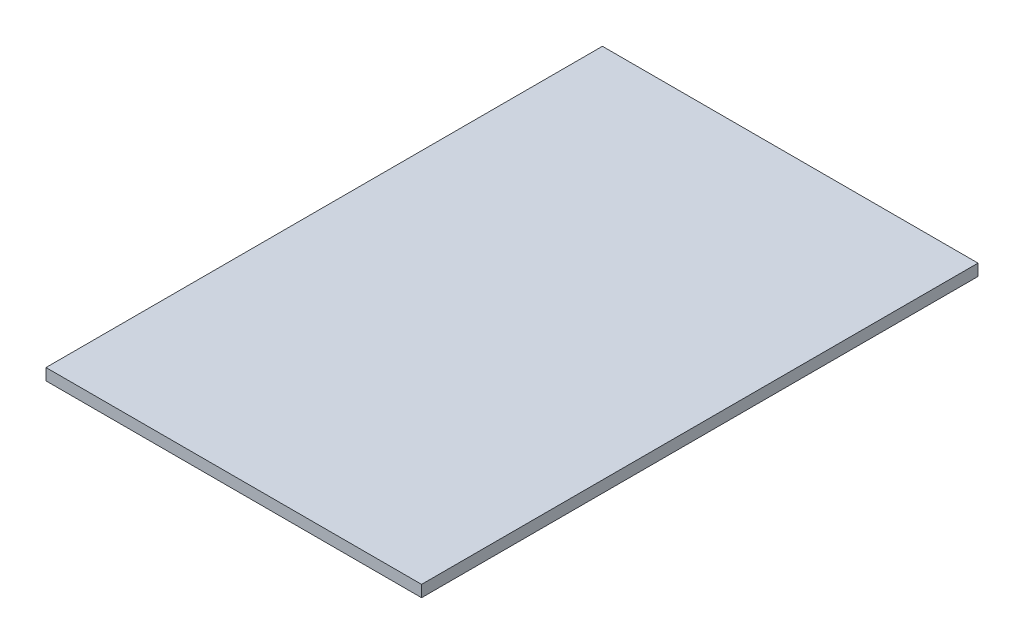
from build123d import *

# Parameters (mm, degrees)
SKETCH2_W           = 81.000000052
SKETCH2_H           = 120.00000003
BOSS_EXTRUDE1_DEPTH = 2.5


with BuildPart() as part:
    # Sketch2 → Boss-Extrude1 (new body)
    with BuildSketch(Plane(origin=(0, 0, 0), x_dir=(1, 0, 0), z_dir=(0, 1, 0))):
        with Locations((-26.00669011, -1.5e-08)):
            Rectangle(SKETCH2_W, SKETCH2_H)
    extrude(amount=BOSS_EXTRUDE1_DEPTH)


solid = part.part
